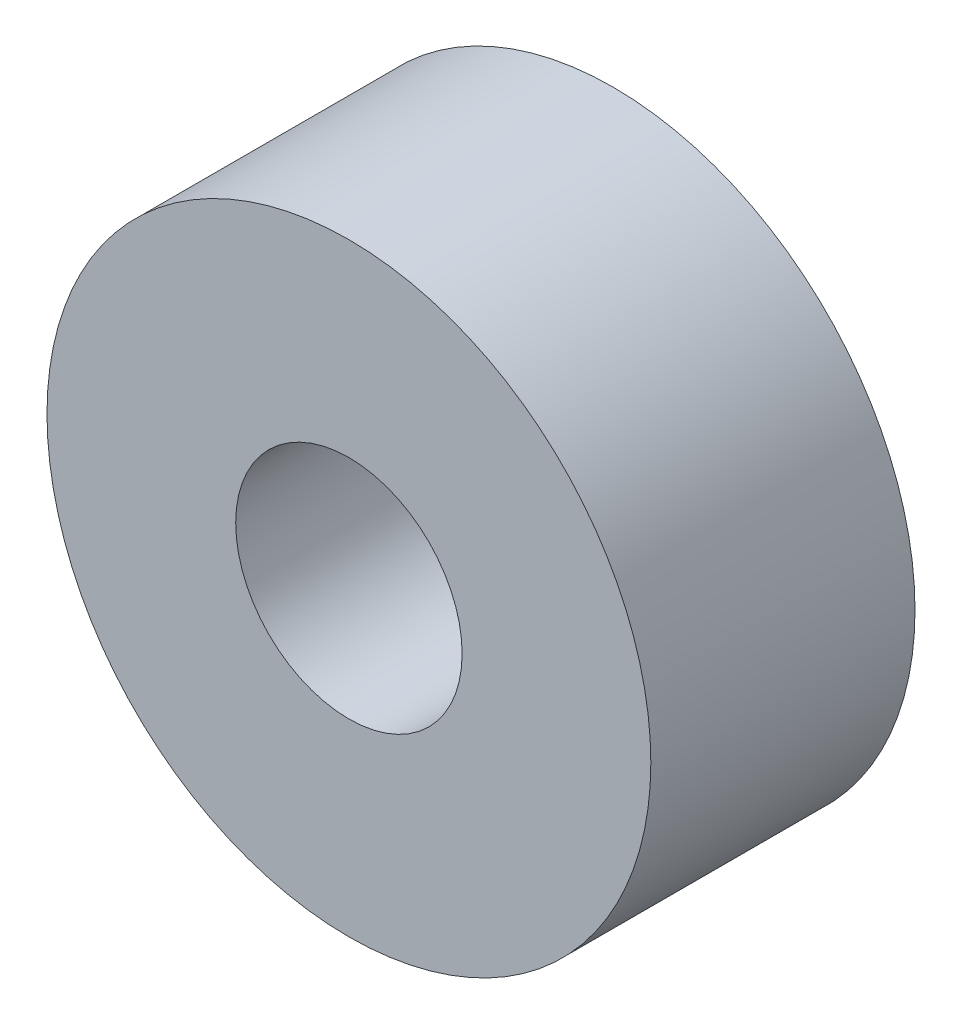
ISO-10303-21;
HEADER;
FILE_DESCRIPTION(('STEP AP214'),'2;1');
FILE_NAME('part.step','',(''),(''),'','','');
FILE_SCHEMA(('AUTOMOTIVE_DESIGN { 1 0 10303 214 1 1 1 1 }'));
ENDSEC;
DATA;
#1=APPLICATION_CONTEXT('core data for automotive mechanical design processes');
#2=APPLICATION_PROTOCOL_DEFINITION('international standard','automotive_design',2000,#1);
#3=PRODUCT_CONTEXT('',#1,'mechanical');
#4=PRODUCT('Part','Part','',(#3));
#5=PRODUCT_RELATED_PRODUCT_CATEGORY('part','',(#4));
#6=PRODUCT_DEFINITION_FORMATION('','',#4);
#7=PRODUCT_DEFINITION_CONTEXT('part definition',#1,'design');
#8=PRODUCT_DEFINITION('design','',#6,#7);
#9=PRODUCT_DEFINITION_SHAPE('','',#8);
#10=(LENGTH_UNIT() NAMED_UNIT(*) SI_UNIT(.MILLI.,.METRE.));
#11=(NAMED_UNIT(*) PLANE_ANGLE_UNIT() SI_UNIT($,.RADIAN.));
#12=(NAMED_UNIT(*) SI_UNIT($,.STERADIAN.) SOLID_ANGLE_UNIT());
#13=UNCERTAINTY_MEASURE_WITH_UNIT(LENGTH_MEASURE(1.E-05),#10,'distance_accuracy_value','');
#14=(GEOMETRIC_REPRESENTATION_CONTEXT(3) GLOBAL_UNCERTAINTY_ASSIGNED_CONTEXT((#13)) GLOBAL_UNIT_ASSIGNED_CONTEXT((#10,
#11,#12)) REPRESENTATION_CONTEXT('',''));
#15=CARTESIAN_POINT('',(0.,0.,0.));
#16=DIRECTION('',(0.,0.,1.));
#17=DIRECTION('',(1.,0.,0.));
#18=AXIS2_PLACEMENT_3D('',#15,#16,#17);
#19=CARTESIAN_POINT('',(0.,0.,-14.8137084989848));
#20=DIRECTION('',(0.,0.,1.));
#21=DIRECTION('',(1.,0.,0.));
#22=AXIS2_PLACEMENT_3D('',#19,#20,#21);
#23=CYLINDRICAL_SURFACE('',#22,4.);
#24=CARTESIAN_POINT('',(0.,0.,0.));
#25=DIRECTION('',(0.,0.,1.));
#26=DIRECTION('',(1.,0.,0.));
#27=AXIS2_PLACEMENT_3D('',#24,#25,#26);
#28=CIRCLE('',#27,4.);
#29=CARTESIAN_POINT('',(4.,0.,0.));
#30=VERTEX_POINT('',#29);
#31=EDGE_CURVE('E37',#30,#30,#28,.T.);
#32=ORIENTED_EDGE('',*,*,#31,.F.);
#33=EDGE_LOOP('',(#32));
#34=FACE_BOUND('',#33,.T.);
#35=CARTESIAN_POINT('',(0.,0.,-3.5));
#36=DIRECTION('',(0.,0.,-1.));
#37=DIRECTION('',(-1.,0.,0.));
#38=AXIS2_PLACEMENT_3D('',#35,#36,#37);
#39=CIRCLE('',#38,4.);
#40=CARTESIAN_POINT('',(-4.,0.,-3.5));
#41=VERTEX_POINT('',#40);
#42=EDGE_CURVE('E46',#41,#41,#39,.F.);
#43=ORIENTED_EDGE('',*,*,#42,.T.);
#44=EDGE_LOOP('',(#43));
#45=FACE_BOUND('',#44,.T.);
#46=ADVANCED_FACE('F30',(#34,#45),#23,.T.);
#47=CARTESIAN_POINT('',(0.,0.,-14.8137084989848));
#48=DIRECTION('',(0.,0.,1.));
#49=DIRECTION('',(1.,0.,0.));
#50=AXIS2_PLACEMENT_3D('',#47,#48,#49);
#51=CYLINDRICAL_SURFACE('',#50,1.5);
#52=CARTESIAN_POINT('',(0.,0.,0.));
#53=DIRECTION('',(0.,0.,1.));
#54=DIRECTION('',(1.,0.,0.));
#55=AXIS2_PLACEMENT_3D('',#52,#53,#54);
#56=CIRCLE('',#55,1.5);
#57=CARTESIAN_POINT('',(1.5,0.,0.));
#58=VERTEX_POINT('',#57);
#59=EDGE_CURVE('E41',#58,#58,#56,.T.);
#60=ORIENTED_EDGE('',*,*,#59,.T.);
#61=EDGE_LOOP('',(#60));
#62=FACE_BOUND('',#61,.T.);
#63=CARTESIAN_POINT('',(0.,0.,-3.5));
#64=DIRECTION('',(0.,0.,-1.));
#65=DIRECTION('',(-1.,0.,0.));
#66=AXIS2_PLACEMENT_3D('',#63,#64,#65);
#67=CIRCLE('',#66,1.5);
#68=CARTESIAN_POINT('',(-1.5,0.,-3.5));
#69=VERTEX_POINT('',#68);
#70=EDGE_CURVE('E10',#69,#69,#67,.F.);
#71=ORIENTED_EDGE('',*,*,#70,.F.);
#72=EDGE_LOOP('',(#71));
#73=FACE_BOUND('',#72,.T.);
#74=ADVANCED_FACE('F57',(#62,#73),#51,.F.);
#75=CARTESIAN_POINT('',(0.,0.,0.));
#76=DIRECTION('',(0.,0.,1.));
#77=DIRECTION('',(1.,0.,0.));
#78=AXIS2_PLACEMENT_3D('',#75,#76,#77);
#79=PLANE('',#78);
#80=ORIENTED_EDGE('',*,*,#59,.F.);
#81=EDGE_LOOP('',(#80));
#82=FACE_BOUND('',#81,.T.);
#83=ORIENTED_EDGE('',*,*,#31,.T.);
#84=EDGE_LOOP('',(#83));
#85=FACE_BOUND('',#84,.T.);
#86=ADVANCED_FACE('F53',(#82,#85),#79,.T.);
#87=CARTESIAN_POINT('',(0.,0.,-3.5));
#88=DIRECTION('',(0.,0.,-1.));
#89=DIRECTION('',(0.,1.,0.));
#90=AXIS2_PLACEMENT_3D('',#87,#88,#89);
#91=PLANE('',#90);
#92=ORIENTED_EDGE('',*,*,#42,.F.);
#93=EDGE_LOOP('',(#92));
#94=FACE_BOUND('',#93,.T.);
#95=ORIENTED_EDGE('',*,*,#70,.T.);
#96=EDGE_LOOP('',(#95));
#97=FACE_BOUND('',#96,.T.);
#98=ADVANCED_FACE('F32',(#94,#97),#91,.T.);
#99=CLOSED_SHELL('',(#46,#74,#86,#98));
#100=MANIFOLD_SOLID_BREP('B2',#99);
#101=ADVANCED_BREP_SHAPE_REPRESENTATION('',(#18,#100),#14);
#102=SHAPE_DEFINITION_REPRESENTATION(#9,#101);
ENDSEC;
END-ISO-10303-21;
